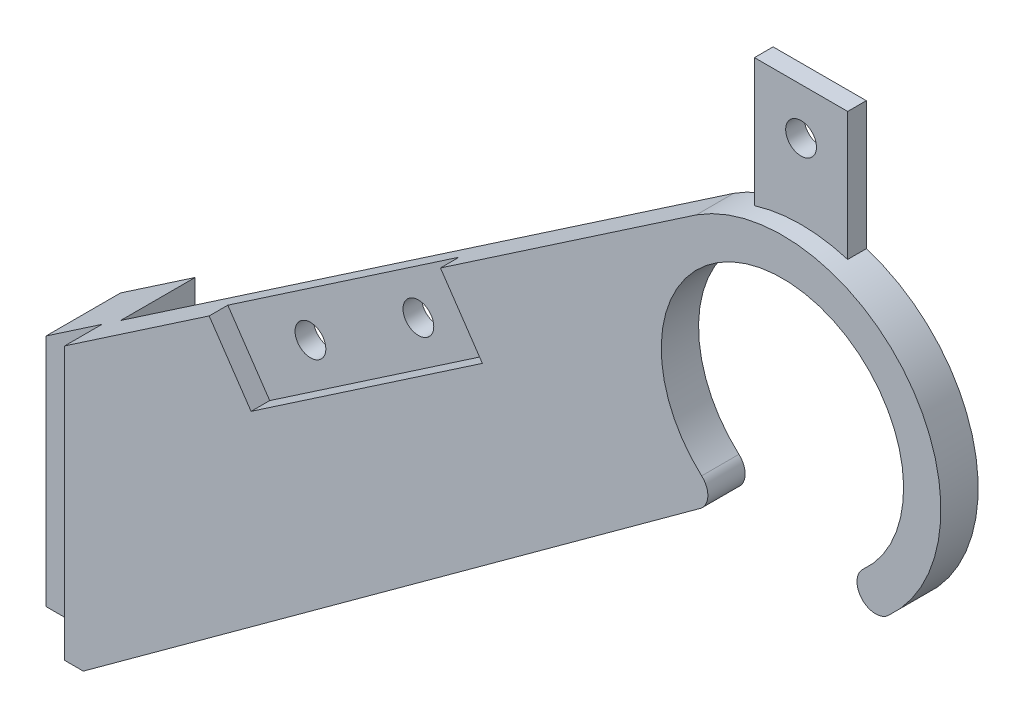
from build123d import *

# Parameters (mm, degrees)
EXTRUDE_1_DEPTH              = 4
EXTRUDE_2_DEPTH              = 8
EXTRUDE_3_DEPTH              = 8
HOLE_WIZARD_M3_1_D           = 3.4
HOLE_WIZARD_M3_1_CSINK_D     = 6.6
HOLE_WIZARD_M3_1_CSINK_ANGLE = 90
CUT_EXTRUDE_1_DEPTH          = 2
HOLE_WIZARD_M4_1_D           = 3.3
EXTRUDE_START                = -4
EXTRUDE_5_DEPTH              = 2
HOLE_WIZARD_M4_3_D           = 3.3
SKETCH_14_W                  = 13.233454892
SKETCH_14_H                  = 37.74599019
CUT_EXTRUDE_2_DEPTH          = 4


with BuildPart() as part:
    # Sketch 1 → Extrude 1 (new body)
    with BuildSketch(Plane.XY):
        with BuildLine():
            Line((-6, 12.639352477), (-6, -12.5))
            Line((-6, -12.5), (2, -12.5))
            Line((2, -12.5), (68.17752444, 35.703047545))
            ThreePointArc((68.17752444, 35.703047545), (68.997490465, 37.219501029), (68.333333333, 38.810372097))
            ThreePointArc((68.333333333, 38.810372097), (77, 61.5), (85.666666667, 38.810372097))
            ThreePointArc((85.666666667, 38.810372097), (85.509288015, 35.986326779), (88.333333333, 35.828948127))
            ThreePointArc((88.333333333, 35.828948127), (90.514788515, 58.812637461), (67.770637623, 62.776514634))
            Line((67.770637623, 62.776514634), (-6, 12.639352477))
        make_face()
    extrude(amount=EXTRUDE_1_DEPTH)

    # Sketch 2 → Extrude 2 (add)
    with BuildSketch(Plane(origin=(0, 0, 0), x_dir=(-1, 0, 0), z_dir=(0, 0, -1))):
        Polygon((-2, 12.639352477), (-2, 18.076438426), (6, 12.639352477), (6, -12.5), (-2, -12.5), align=None)
    extrude(amount=EXTRUDE_2_DEPTH)

    # Sketch 2_2 → Extrude 3 (add)
    with BuildSketch(Plane(origin=(0, 0, 0), x_dir=(-1, 0, 0), z_dir=(0, 0, -1))):
        Polygon((-2, 12.639352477), (-2, 18.076438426), (6, 12.639352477), (6, -12.5), (-2, -12.5), align=None)
    extrude(amount=EXTRUDE_3_DEPTH)

    # Hole Wizard M3 _1 (through all)
    with Locations(Plane(origin=(2, 0, 0), x_dir=(0, 0, -1), z_dir=(1, 0, 0))):
        with Locations((4, 7.139352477), (4, -5.860647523)):
            CounterSinkHole(HOLE_WIZARD_M3_1_D / 2, HOLE_WIZARD_M3_1_CSINK_D / 2, counter_sink_angle=HOLE_WIZARD_M3_1_CSINK_ANGLE)

    # Sketch 5 → Cut-Extrude 1 (cut)
    with BuildSketch(Plane.XY.offset(4)):
        Polygon((15.503168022, 27.253674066), (40.315164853, 44.116793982), (44.81199683, 37.500261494), (20, 20.637141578), align=None)
    extrude(amount=-CUT_EXTRUDE_1_DEPTH, mode=Mode.SUBTRACT)

    # Hole Wizard M4 _1 (through all)
    with Locations(Plane.XY.offset(2)):
        with Locations((24.368116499, 28.4422398), (35.947048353, 36.311695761)):
            Hole(HOLE_WIZARD_M4_1_D / 2)

    # Sketch 11 → Extrude 5 (add)
    with BuildSketch(Plane.XY.offset(4).offset(EXTRUDE_START)):
        with BuildLine():
            Line((72, 64.748076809), (72, 78.5))
            Line((72, 78.5), (82, 78.5))
            Line((82, 78.5), (82, 64.748076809))
            ThreePointArc((82, 64.748076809), (77, 65.5), (72, 64.748076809))
        make_face()
    extrude(amount=EXTRUDE_5_DEPTH)

    # Hole Wizard M4 _3 (through all)
    with Locations(Plane.XY.offset(2)):
        with Locations((77, 73.5)):
            Hole(HOLE_WIZARD_M4_3_D / 2)

    # Sketch 14 → Cut-Extrude 2 (cut)
    with BuildSketch(Plane.XY.offset(4)):
        with Locations((-6.616727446, 2.364300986)):
            Rectangle(SKETCH_14_W, SKETCH_14_H)
    extrude(amount=-CUT_EXTRUDE_2_DEPTH, mode=Mode.SUBTRACT)


solid = part.part
